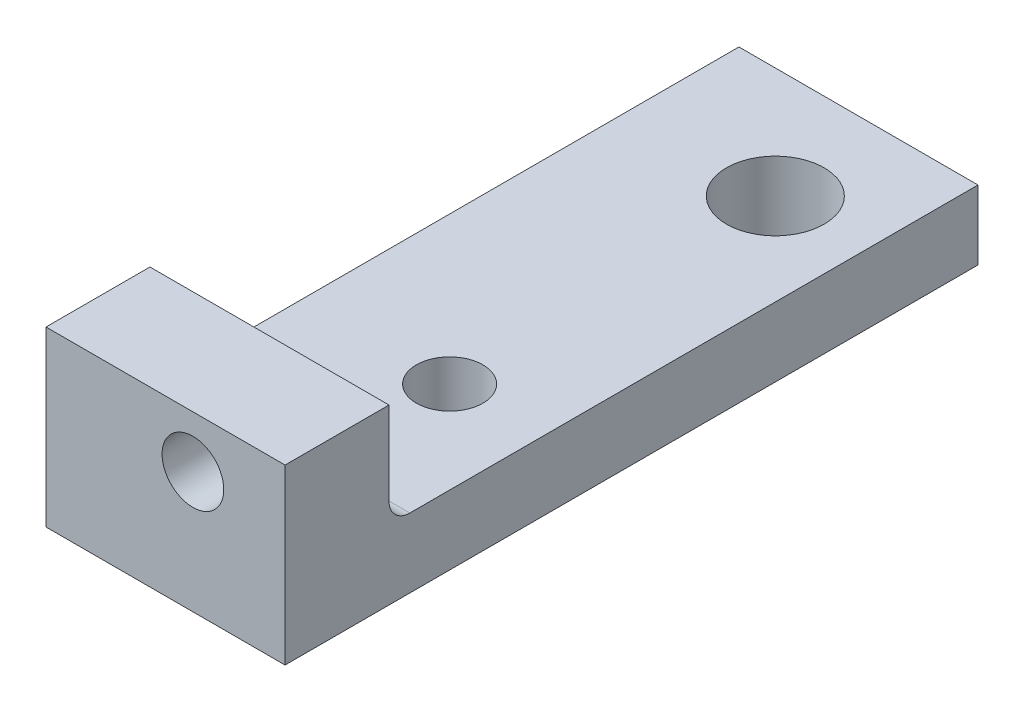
ISO-10303-21;
HEADER;
FILE_DESCRIPTION(('STEP AP214'),'2;1');
FILE_NAME('part.step','',(''),(''),'','','');
FILE_SCHEMA(('AUTOMOTIVE_DESIGN { 1 0 10303 214 1 1 1 1 }'));
ENDSEC;
DATA;
#1=APPLICATION_CONTEXT('core data for automotive mechanical design processes');
#2=APPLICATION_PROTOCOL_DEFINITION('international standard','automotive_design',2000,#1);
#3=PRODUCT_CONTEXT('',#1,'mechanical');
#4=PRODUCT('Part','Part','',(#3));
#5=PRODUCT_RELATED_PRODUCT_CATEGORY('part','',(#4));
#6=PRODUCT_DEFINITION_FORMATION('','',#4);
#7=PRODUCT_DEFINITION_CONTEXT('part definition',#1,'design');
#8=PRODUCT_DEFINITION('design','',#6,#7);
#9=PRODUCT_DEFINITION_SHAPE('','',#8);
#10=(LENGTH_UNIT() NAMED_UNIT(*) SI_UNIT(.MILLI.,.METRE.));
#11=(NAMED_UNIT(*) PLANE_ANGLE_UNIT() SI_UNIT($,.RADIAN.));
#12=(NAMED_UNIT(*) SI_UNIT($,.STERADIAN.) SOLID_ANGLE_UNIT());
#13=UNCERTAINTY_MEASURE_WITH_UNIT(LENGTH_MEASURE(1.E-05),#10,'distance_accuracy_value','');
#14=(GEOMETRIC_REPRESENTATION_CONTEXT(3) GLOBAL_UNCERTAINTY_ASSIGNED_CONTEXT((#13)) GLOBAL_UNIT_ASSIGNED_CONTEXT((#10,
#11,#12)) REPRESENTATION_CONTEXT('',''));
#15=CARTESIAN_POINT('',(0.,0.,0.));
#16=DIRECTION('',(0.,0.,1.));
#17=DIRECTION('',(1.,0.,0.));
#18=AXIS2_PLACEMENT_3D('',#15,#16,#17);
#19=CARTESIAN_POINT('',(-6.096,12.7,33.02));
#20=DIRECTION('',(0.,1.,0.));
#21=DIRECTION('',(0.,0.,1.));
#22=AXIS2_PLACEMENT_3D('',#19,#20,#21);
#23=PLANE('',#22);
#24=CARTESIAN_POINT('',(-2.6035,12.7,27.432));
#25=DIRECTION('',(0.,1.,0.));
#26=DIRECTION('',(0.,0.,1.));
#27=AXIS2_PLACEMENT_3D('',#24,#25,#26);
#28=CIRCLE('',#27,1.7907);
#29=CARTESIAN_POINT('',(-2.6035,12.7,29.2227));
#30=VERTEX_POINT('',#29);
#31=EDGE_CURVE('E119',#30,#30,#28,.T.);
#32=ORIENTED_EDGE('',*,*,#31,.T.);
#33=EDGE_LOOP('',(#32));
#34=FACE_BOUND('',#33,.T.);
#35=CARTESIAN_POINT('',(-2.6035,12.7,39.37));
#36=DIRECTION('',(0.,1.,0.));
#37=DIRECTION('',(0.,0.,1.));
#38=AXIS2_PLACEMENT_3D('',#35,#36,#37);
#39=CIRCLE('',#38,1.2192);
#40=CARTESIAN_POINT('',(-2.6035,12.7,40.5892));
#41=VERTEX_POINT('',#40);
#42=EDGE_CURVE('E116',#41,#41,#39,.T.);
#43=ORIENTED_EDGE('',*,*,#42,.T.);
#44=EDGE_LOOP('',(#43));
#45=FACE_BOUND('',#44,.T.);
#46=DIRECTION('',(-1.,0.,0.));
#47=VECTOR('',#46,1.);
#48=CARTESIAN_POINT('',(4.82405952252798,12.7,23.368));
#49=LINE('',#48,#47);
#50=CARTESIAN_POINT('',(0.761999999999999,12.7,23.368));
#51=VERTEX_POINT('',#50);
#52=CARTESIAN_POINT('',(-8.001,12.7,23.368));
#53=VERTEX_POINT('',#52);
#54=EDGE_CURVE('E96',#51,#53,#49,.T.);
#55=ORIENTED_EDGE('',*,*,#54,.F.);
#56=DIRECTION('',(0.,0.,1.));
#57=VECTOR('',#56,1.);
#58=CARTESIAN_POINT('',(0.761999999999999,12.7,9.271));
#59=LINE('',#58,#57);
#60=CARTESIAN_POINT('',(0.761999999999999,12.7,48.768));
#61=VERTEX_POINT('',#60);
#62=EDGE_CURVE('E106',#51,#61,#59,.T.);
#63=ORIENTED_EDGE('',*,*,#62,.T.);
#64=DIRECTION('',(1.,0.,0.));
#65=VECTOR('',#64,1.);
#66=CARTESIAN_POINT('',(-16.9812561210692,12.7,48.768));
#67=LINE('',#66,#65);
#68=CARTESIAN_POINT('',(-8.001,12.7,48.768));
#69=VERTEX_POINT('',#68);
#70=EDGE_CURVE('E121',#69,#61,#67,.T.);
#71=ORIENTED_EDGE('',*,*,#70,.F.);
#72=DIRECTION('',(0.,0.,1.));
#73=VECTOR('',#72,1.);
#74=CARTESIAN_POINT('',(-8.001,12.7,9.271));
#75=LINE('',#74,#73);
#76=EDGE_CURVE('E108',#53,#69,#75,.T.);
#77=ORIENTED_EDGE('',*,*,#76,.F.);
#78=EDGE_LOOP('',(#55,#63,#71,#77));
#79=FACE_BOUND('',#78,.T.);
#80=ADVANCED_FACE('F35',(#34,#45,#79),#23,.F.);
#81=CARTESIAN_POINT('',(-2.6035,12.69995,27.432));
#82=DIRECTION('',(0.,1.,0.));
#83=DIRECTION('',(0.,0.,1.));
#84=AXIS2_PLACEMENT_3D('',#81,#82,#83);
#85=CYLINDRICAL_SURFACE('',#84,1.7907);
#86=ORIENTED_EDGE('',*,*,#31,.F.);
#87=EDGE_LOOP('',(#86));
#88=FACE_BOUND('',#87,.T.);
#89=CARTESIAN_POINT('',(-2.6035,15.24,27.432));
#90=DIRECTION('',(0.,1.,0.));
#91=DIRECTION('',(0.,0.,1.));
#92=AXIS2_PLACEMENT_3D('',#89,#90,#91);
#93=CIRCLE('',#92,1.7907);
#94=CARTESIAN_POINT('',(-2.6035,15.24,29.2227));
#95=VERTEX_POINT('',#94);
#96=EDGE_CURVE('E131',#95,#95,#93,.F.);
#97=ORIENTED_EDGE('',*,*,#96,.F.);
#98=EDGE_LOOP('',(#97));
#99=FACE_BOUND('',#98,.T.);
#100=ADVANCED_FACE('F200',(#88,#99),#85,.F.);
#101=CARTESIAN_POINT('',(-2.6035,19.05,39.37));
#102=DIRECTION('',(0.,1.,0.));
#103=DIRECTION('',(0.,0.,1.));
#104=AXIS2_PLACEMENT_3D('',#101,#102,#103);
#105=CYLINDRICAL_SURFACE('',#104,1.2192);
#106=ORIENTED_EDGE('',*,*,#42,.F.);
#107=EDGE_LOOP('',(#106));
#108=FACE_BOUND('',#107,.T.);
#109=CARTESIAN_POINT('',(-2.6035,15.24,39.37));
#110=DIRECTION('',(0.,1.,0.));
#111=DIRECTION('',(0.,0.,1.));
#112=AXIS2_PLACEMENT_3D('',#109,#110,#111);
#113=CIRCLE('',#112,1.2192);
#114=CARTESIAN_POINT('',(-2.6035,15.24,40.5892));
#115=VERTEX_POINT('',#114);
#116=EDGE_CURVE('E101',#115,#115,#113,.F.);
#117=ORIENTED_EDGE('',*,*,#116,.F.);
#118=EDGE_LOOP('',(#117));
#119=FACE_BOUND('',#118,.T.);
#120=ADVANCED_FACE('F205',(#108,#119),#105,.F.);
#121=CARTESIAN_POINT('',(0.761999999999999,12.7,9.271));
#122=DIRECTION('',(-1.,0.,0.));
#123=DIRECTION('',(0.,0.,1.));
#124=AXIS2_PLACEMENT_3D('',#121,#122,#123);
#125=PLANE('',#124);
#126=DIRECTION('',(0.,-1.,0.));
#127=VECTOR('',#126,1.);
#128=CARTESIAN_POINT('',(0.761999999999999,12.7,23.368));
#129=LINE('',#128,#127);
#130=CARTESIAN_POINT('',(0.761999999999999,15.24,23.368));
#131=VERTEX_POINT('',#130);
#132=EDGE_CURVE('E92',#131,#51,#129,.T.);
#133=ORIENTED_EDGE('',*,*,#132,.F.);
#134=DIRECTION('',(0.,0.,1.));
#135=VECTOR('',#134,1.);
#136=CARTESIAN_POINT('',(0.761999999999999,15.24,44.958));
#137=LINE('',#136,#135);
#138=CARTESIAN_POINT('',(0.761999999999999,15.24,44.196));
#139=VERTEX_POINT('',#138);
#140=EDGE_CURVE('E128',#131,#139,#137,.T.);
#141=ORIENTED_EDGE('',*,*,#140,.T.);
#142=CARTESIAN_POINT('',(0.761999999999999,16.002,44.196));
#143=DIRECTION('',(-1.,0.,0.));
#144=DIRECTION('',(0.,0.,1.));
#145=AXIS2_PLACEMENT_3D('',#142,#143,#144);
#146=CIRCLE('',#145,0.762);
#147=CARTESIAN_POINT('',(0.761999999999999,16.002,44.958));
#148=VERTEX_POINT('',#147);
#149=EDGE_CURVE('E43',#139,#148,#146,.T.);
#150=ORIENTED_EDGE('',*,*,#149,.T.);
#151=DIRECTION('',(0.,1.,0.));
#152=VECTOR('',#151,1.);
#153=CARTESIAN_POINT('',(0.761999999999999,19.05,44.958));
#154=LINE('',#153,#152);
#155=CARTESIAN_POINT('',(0.761999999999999,19.05,44.958));
#156=VERTEX_POINT('',#155);
#157=EDGE_CURVE('E130',#148,#156,#154,.T.);
#158=ORIENTED_EDGE('',*,*,#157,.T.);
#159=DIRECTION('',(0.,0.,1.));
#160=VECTOR('',#159,1.);
#161=CARTESIAN_POINT('',(0.761999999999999,19.05,48.768));
#162=LINE('',#161,#160);
#163=CARTESIAN_POINT('',(0.761999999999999,19.05,48.768));
#164=VERTEX_POINT('',#163);
#165=EDGE_CURVE('E170',#156,#164,#162,.T.);
#166=ORIENTED_EDGE('',*,*,#165,.T.);
#167=DIRECTION('',(0.,-1.,0.));
#168=VECTOR('',#167,1.);
#169=CARTESIAN_POINT('',(0.761999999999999,12.7,48.768));
#170=LINE('',#169,#168);
#171=EDGE_CURVE('E115',#164,#61,#170,.T.);
#172=ORIENTED_EDGE('',*,*,#171,.T.);
#173=ORIENTED_EDGE('',*,*,#62,.F.);
#174=EDGE_LOOP('',(#133,#141,#150,#158,#166,#172,#173));
#175=FACE_BOUND('',#174,.T.);
#176=ADVANCED_FACE('F112',(#175),#125,.F.);
#177=CARTESIAN_POINT('',(-8.001,12.7,9.271));
#178=DIRECTION('',(-1.,0.,0.));
#179=DIRECTION('',(0.,0.,1.));
#180=AXIS2_PLACEMENT_3D('',#177,#178,#179);
#181=PLANE('',#180);
#182=DIRECTION('',(0.,0.,1.));
#183=VECTOR('',#182,1.);
#184=CARTESIAN_POINT('',(-8.001,15.24,44.958));
#185=LINE('',#184,#183);
#186=CARTESIAN_POINT('',(-8.001,15.24,23.368));
#187=VERTEX_POINT('',#186);
#188=CARTESIAN_POINT('',(-8.001,15.24,44.196));
#189=VERTEX_POINT('',#188);
#190=EDGE_CURVE('E134',#187,#189,#185,.T.);
#191=ORIENTED_EDGE('',*,*,#190,.F.);
#192=DIRECTION('',(0.,-1.,0.));
#193=VECTOR('',#192,1.);
#194=CARTESIAN_POINT('',(-8.001,12.7,23.368));
#195=LINE('',#194,#193);
#196=EDGE_CURVE('E127',#187,#53,#195,.T.);
#197=ORIENTED_EDGE('',*,*,#196,.T.);
#198=ORIENTED_EDGE('',*,*,#76,.T.);
#199=DIRECTION('',(0.,-1.,0.));
#200=VECTOR('',#199,1.);
#201=CARTESIAN_POINT('',(-8.001,12.7,48.768));
#202=LINE('',#201,#200);
#203=CARTESIAN_POINT('',(-8.001,19.05,48.768));
#204=VERTEX_POINT('',#203);
#205=EDGE_CURVE('E163',#204,#69,#202,.T.);
#206=ORIENTED_EDGE('',*,*,#205,.F.);
#207=DIRECTION('',(0.,0.,1.));
#208=VECTOR('',#207,1.);
#209=CARTESIAN_POINT('',(-8.001,19.05,48.768));
#210=LINE('',#209,#208);
#211=CARTESIAN_POINT('',(-8.001,19.05,44.958));
#212=VERTEX_POINT('',#211);
#213=EDGE_CURVE('E154',#212,#204,#210,.T.);
#214=ORIENTED_EDGE('',*,*,#213,.F.);
#215=DIRECTION('',(0.,1.,0.));
#216=VECTOR('',#215,1.);
#217=CARTESIAN_POINT('',(-8.001,19.05,44.958));
#218=LINE('',#217,#216);
#219=CARTESIAN_POINT('',(-8.001,16.002,44.958));
#220=VERTEX_POINT('',#219);
#221=EDGE_CURVE('E137',#220,#212,#218,.T.);
#222=ORIENTED_EDGE('',*,*,#221,.F.);
#223=CARTESIAN_POINT('',(-8.001,16.002,44.196));
#224=DIRECTION('',(-1.,0.,0.));
#225=DIRECTION('',(0.,0.,1.));
#226=AXIS2_PLACEMENT_3D('',#223,#224,#225);
#227=CIRCLE('',#226,0.762);
#228=EDGE_CURVE('E11',#220,#189,#227,.F.);
#229=ORIENTED_EDGE('',*,*,#228,.T.);
#230=EDGE_LOOP('',(#191,#197,#198,#206,#214,#222,#229));
#231=FACE_BOUND('',#230,.T.);
#232=ADVANCED_FACE('F151',(#231),#181,.T.);
#233=CARTESIAN_POINT('',(-16.9812561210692,15.24,44.958));
#234=DIRECTION('',(0.,1.,0.));
#235=DIRECTION('',(0.,0.,1.));
#236=AXIS2_PLACEMENT_3D('',#233,#234,#235);
#237=PLANE('',#236);
#238=ORIENTED_EDGE('',*,*,#190,.T.);
#239=DIRECTION('',(1.,0.,0.));
#240=VECTOR('',#239,1.);
#241=CARTESIAN_POINT('',(0.761999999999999,15.24,44.196));
#242=LINE('',#241,#240);
#243=EDGE_CURVE('E141',#189,#139,#242,.T.);
#244=ORIENTED_EDGE('',*,*,#243,.T.);
#245=ORIENTED_EDGE('',*,*,#140,.F.);
#246=DIRECTION('',(-1.,0.,0.));
#247=VECTOR('',#246,1.);
#248=CARTESIAN_POINT('',(4.82405952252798,15.24,23.368));
#249=LINE('',#248,#247);
#250=EDGE_CURVE('E99',#131,#187,#249,.T.);
#251=ORIENTED_EDGE('',*,*,#250,.T.);
#252=EDGE_LOOP('',(#238,#244,#245,#251));
#253=FACE_BOUND('',#252,.T.);
#254=ORIENTED_EDGE('',*,*,#116,.T.);
#255=EDGE_LOOP('',(#254));
#256=FACE_BOUND('',#255,.T.);
#257=ORIENTED_EDGE('',*,*,#96,.T.);
#258=EDGE_LOOP('',(#257));
#259=FACE_BOUND('',#258,.T.);
#260=ADVANCED_FACE('F146',(#253,#256,#259),#237,.T.);
#261=CARTESIAN_POINT('',(-16.9812561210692,19.05,44.958));
#262=DIRECTION('',(0.,0.,-1.));
#263=DIRECTION('',(-1.,0.,0.));
#264=AXIS2_PLACEMENT_3D('',#261,#262,#263);
#265=PLANE('',#264);
#266=CARTESIAN_POINT('',(-2.6162,17.145,44.958));
#267=DIRECTION('',(0.,0.,-1.));
#268=DIRECTION('',(-1.,0.,0.));
#269=AXIS2_PLACEMENT_3D('',#266,#267,#268);
#270=CIRCLE('',#269,1.13029999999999);
#271=CARTESIAN_POINT('',(-3.74649999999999,17.145,44.958));
#272=VERTEX_POINT('',#271);
#273=EDGE_CURVE('E109',#272,#272,#270,.T.);
#274=ORIENTED_EDGE('',*,*,#273,.F.);
#275=EDGE_LOOP('',(#274));
#276=FACE_BOUND('',#275,.T.);
#277=ORIENTED_EDGE('',*,*,#157,.F.);
#278=DIRECTION('',(1.,0.,0.));
#279=VECTOR('',#278,1.);
#280=CARTESIAN_POINT('',(-8.001,16.002,44.958));
#281=LINE('',#280,#279);
#282=EDGE_CURVE('E56',#148,#220,#281,.F.);
#283=ORIENTED_EDGE('',*,*,#282,.T.);
#284=ORIENTED_EDGE('',*,*,#221,.T.);
#285=DIRECTION('',(1.,0.,0.));
#286=VECTOR('',#285,1.);
#287=CARTESIAN_POINT('',(-16.9812561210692,19.05,44.958));
#288=LINE('',#287,#286);
#289=EDGE_CURVE('E157',#212,#156,#288,.T.);
#290=ORIENTED_EDGE('',*,*,#289,.T.);
#291=EDGE_LOOP('',(#277,#283,#284,#290));
#292=FACE_BOUND('',#291,.T.);
#293=ADVANCED_FACE('F171',(#276,#292),#265,.T.);
#294=CARTESIAN_POINT('',(-16.9812561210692,19.05,48.768));
#295=DIRECTION('',(0.,1.,0.));
#296=DIRECTION('',(0.,0.,1.));
#297=AXIS2_PLACEMENT_3D('',#294,#295,#296);
#298=PLANE('',#297);
#299=ORIENTED_EDGE('',*,*,#289,.F.);
#300=ORIENTED_EDGE('',*,*,#213,.T.);
#301=DIRECTION('',(1.,0.,0.));
#302=VECTOR('',#301,1.);
#303=CARTESIAN_POINT('',(-16.9812561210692,19.05,48.768));
#304=LINE('',#303,#302);
#305=EDGE_CURVE('E164',#204,#164,#304,.T.);
#306=ORIENTED_EDGE('',*,*,#305,.T.);
#307=ORIENTED_EDGE('',*,*,#165,.F.);
#308=EDGE_LOOP('',(#299,#300,#306,#307));
#309=FACE_BOUND('',#308,.T.);
#310=ADVANCED_FACE('F169',(#309),#298,.T.);
#311=CARTESIAN_POINT('',(-16.9812561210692,12.7,48.768));
#312=DIRECTION('',(0.,0.,1.));
#313=DIRECTION('',(1.,0.,0.));
#314=AXIS2_PLACEMENT_3D('',#311,#312,#313);
#315=PLANE('',#314);
#316=CARTESIAN_POINT('',(-2.6162,17.145,48.768));
#317=DIRECTION('',(0.,0.,1.));
#318=DIRECTION('',(1.,0.,0.));
#319=AXIS2_PLACEMENT_3D('',#316,#317,#318);
#320=CIRCLE('',#319,1.13029999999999);
#321=CARTESIAN_POINT('',(-1.48590000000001,17.145,48.768));
#322=VERTEX_POINT('',#321);
#323=EDGE_CURVE('E183',#322,#322,#320,.T.);
#324=ORIENTED_EDGE('',*,*,#323,.F.);
#325=EDGE_LOOP('',(#324));
#326=FACE_BOUND('',#325,.T.);
#327=ORIENTED_EDGE('',*,*,#305,.F.);
#328=ORIENTED_EDGE('',*,*,#205,.T.);
#329=ORIENTED_EDGE('',*,*,#70,.T.);
#330=ORIENTED_EDGE('',*,*,#171,.F.);
#331=EDGE_LOOP('',(#327,#328,#329,#330));
#332=FACE_BOUND('',#331,.T.);
#333=ADVANCED_FACE('F189',(#326,#332),#315,.T.);
#334=CARTESIAN_POINT('',(4.82405952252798,15.24,23.368));
#335=DIRECTION('',(0.,0.,-1.));
#336=DIRECTION('',(-1.,0.,0.));
#337=AXIS2_PLACEMENT_3D('',#334,#335,#336);
#338=PLANE('',#337);
#339=ORIENTED_EDGE('',*,*,#132,.T.);
#340=ORIENTED_EDGE('',*,*,#54,.T.);
#341=ORIENTED_EDGE('',*,*,#196,.F.);
#342=ORIENTED_EDGE('',*,*,#250,.F.);
#343=EDGE_LOOP('',(#339,#340,#341,#342));
#344=FACE_BOUND('',#343,.T.);
#345=ADVANCED_FACE('F94',(#344),#338,.T.);
#346=CARTESIAN_POINT('',(-2.6162,17.145,48.768));
#347=DIRECTION('',(0.,0.,1.));
#348=DIRECTION('',(1.,0.,0.));
#349=AXIS2_PLACEMENT_3D('',#346,#347,#348);
#350=CYLINDRICAL_SURFACE('',#349,1.13029999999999);
#351=ORIENTED_EDGE('',*,*,#273,.T.);
#352=EDGE_LOOP('',(#351));
#353=FACE_BOUND('',#352,.T.);
#354=ORIENTED_EDGE('',*,*,#323,.T.);
#355=EDGE_LOOP('',(#354));
#356=FACE_BOUND('',#355,.T.);
#357=ADVANCED_FACE('F187',(#353,#356),#350,.F.);
#358=CARTESIAN_POINT('',(-16.9812561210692,16.002,44.196));
#359=DIRECTION('',(-1.,0.,0.));
#360=DIRECTION('',(0.,0.,1.));
#361=AXIS2_PLACEMENT_3D('',#358,#359,#360);
#362=CYLINDRICAL_SURFACE('',#361,0.762);
#363=ORIENTED_EDGE('',*,*,#228,.F.);
#364=ORIENTED_EDGE('',*,*,#282,.F.);
#365=ORIENTED_EDGE('',*,*,#149,.F.);
#366=ORIENTED_EDGE('',*,*,#243,.F.);
#367=EDGE_LOOP('',(#363,#364,#365,#366));
#368=FACE_BOUND('',#367,.T.);
#369=ADVANCED_FACE('F37',(#368),#362,.F.);
#370=CLOSED_SHELL('',(#80,#100,#120,#176,#232,#260,#293,#310,#333,#345,#357,#369));
#371=MANIFOLD_SOLID_BREP('B2',#370);
#372=ADVANCED_BREP_SHAPE_REPRESENTATION('',(#18,#371),#14);
#373=SHAPE_DEFINITION_REPRESENTATION(#9,#372);
ENDSEC;
END-ISO-10303-21;
